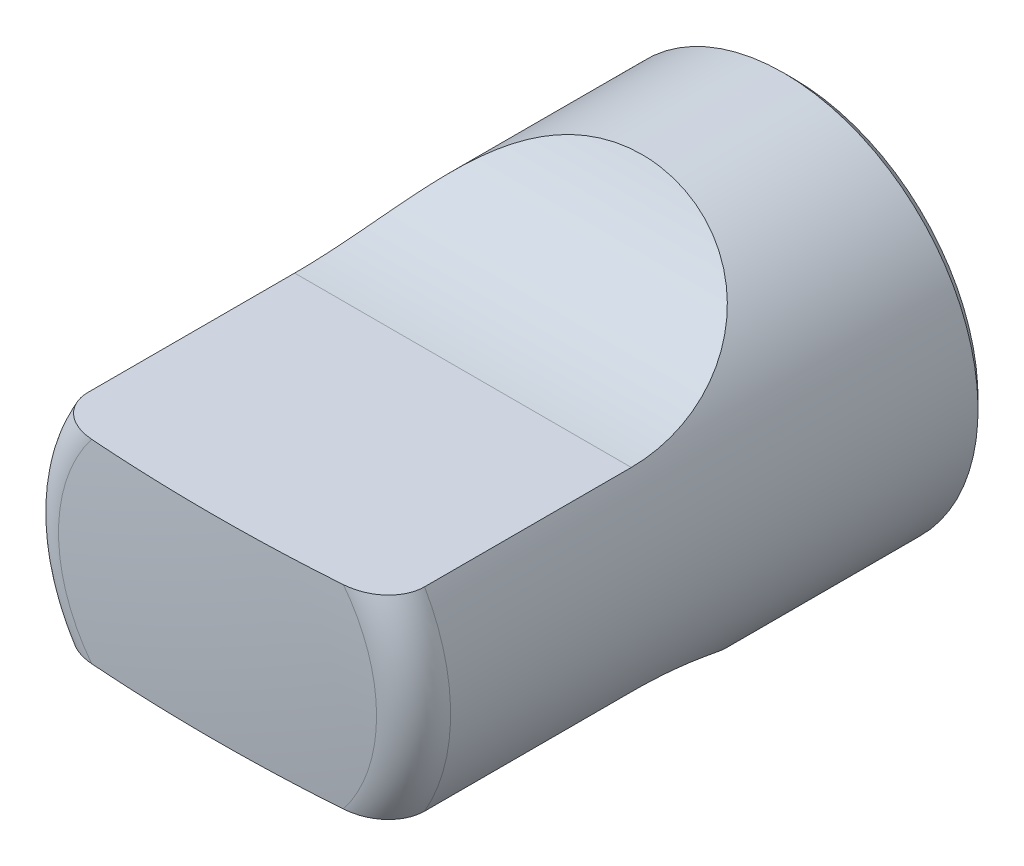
ISO-10303-21;
HEADER;
FILE_DESCRIPTION(('STEP AP214'),'2;1');
FILE_NAME('part.step','',(''),(''),'','','');
FILE_SCHEMA(('AUTOMOTIVE_DESIGN { 1 0 10303 214 1 1 1 1 }'));
ENDSEC;
DATA;
#1=APPLICATION_CONTEXT('core data for automotive mechanical design processes');
#2=APPLICATION_PROTOCOL_DEFINITION('international standard','automotive_design',2000,#1);
#3=PRODUCT_CONTEXT('',#1,'mechanical');
#4=PRODUCT('Part','Part','',(#3));
#5=PRODUCT_RELATED_PRODUCT_CATEGORY('part','',(#4));
#6=PRODUCT_DEFINITION_FORMATION('','',#4);
#7=PRODUCT_DEFINITION_CONTEXT('part definition',#1,'design');
#8=PRODUCT_DEFINITION('design','',#6,#7);
#9=PRODUCT_DEFINITION_SHAPE('','',#8);
#10=(LENGTH_UNIT() NAMED_UNIT(*) SI_UNIT(.MILLI.,.METRE.));
#11=(NAMED_UNIT(*) PLANE_ANGLE_UNIT() SI_UNIT($,.RADIAN.));
#12=(NAMED_UNIT(*) SI_UNIT($,.STERADIAN.) SOLID_ANGLE_UNIT());
#13=UNCERTAINTY_MEASURE_WITH_UNIT(LENGTH_MEASURE(1.E-05),#10,'distance_accuracy_value','');
#14=(GEOMETRIC_REPRESENTATION_CONTEXT(3) GLOBAL_UNCERTAINTY_ASSIGNED_CONTEXT((#13)) GLOBAL_UNIT_ASSIGNED_CONTEXT((#10,
#11,#12)) REPRESENTATION_CONTEXT('',''));
#15=CARTESIAN_POINT('',(0.,0.,0.));
#16=DIRECTION('',(0.,0.,1.));
#17=DIRECTION('',(1.,0.,0.));
#18=AXIS2_PLACEMENT_3D('',#15,#16,#17);
#19=CARTESIAN_POINT('',(1.24032728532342E-13,0.,-59.9999999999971));
#20=DIRECTION('',(0.,0.,-1.));
#21=DIRECTION('',(1.,0.,0.));
#22=AXIS2_PLACEMENT_3D('',#19,#20,#21);
#23=SPHERICAL_SURFACE('',#22,89.9999999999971);
#24=CARTESIAN_POINT('',(0.,0.,29.6273275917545));
#25=DIRECTION('',(0.,0.,-1.));
#26=DIRECTION('',(0.,1.,0.));
#27=AXIS2_PLACEMENT_3D('',#24,#25,#26);
#28=CIRCLE('',#27,8.18181818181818);
#29=CARTESIAN_POINT('',(-6.47627584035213,-5.,29.6273275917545));
#30=VERTEX_POINT('',#29);
#31=CARTESIAN_POINT('',(-6.47627584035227,5.,29.6273275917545));
#32=VERTEX_POINT('',#31);
#33=EDGE_CURVE('E135',#30,#32,#28,.T.);
#34=ORIENTED_EDGE('',*,*,#33,.F.);
#35=CARTESIAN_POINT('',(1.24032728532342E-13,-5.,-59.9999999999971));
#36=DIRECTION('',(0.,-1.,0.));
#37=DIRECTION('',(1.,0.,0.));
#38=AXIS2_PLACEMENT_3D('',#35,#36,#37);
#39=CIRCLE('',#38,89.8610037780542);
#40=CARTESIAN_POINT('',(6.47627584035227,-5.,29.6273275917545));
#41=VERTEX_POINT('',#40);
#42=EDGE_CURVE('E136',#30,#41,#39,.F.);
#43=ORIENTED_EDGE('',*,*,#42,.T.);
#44=CARTESIAN_POINT('',(6.47627584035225,5.,29.6273275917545));
#45=VERTEX_POINT('',#44);
#46=EDGE_CURVE('E69',#45,#41,#28,.T.);
#47=ORIENTED_EDGE('',*,*,#46,.F.);
#48=CARTESIAN_POINT('',(1.24032728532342E-13,5.,-59.9999999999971));
#49=DIRECTION('',(0.,1.,0.));
#50=DIRECTION('',(-1.,0.,0.));
#51=AXIS2_PLACEMENT_3D('',#48,#49,#50);
#52=CIRCLE('',#51,89.8610037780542);
#53=EDGE_CURVE('E139',#45,#32,#52,.F.);
#54=ORIENTED_EDGE('',*,*,#53,.T.);
#55=EDGE_LOOP('',(#34,#43,#47,#54));
#56=FACE_BOUND('',#55,.T.);
#57=ADVANCED_FACE('F14',(#56),#23,.T.);
#58=CARTESIAN_POINT('',(0.,0.,27.6356092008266));
#59=DIRECTION('',(0.,0.,-1.));
#60=DIRECTION('',(0.,1.,0.));
#61=AXIS2_PLACEMENT_3D('',#58,#59,#60);
#62=TOROIDAL_SURFACE('',#61,8.,2.);
#63=CARTESIAN_POINT('',(0.,0.,27.6356092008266));
#64=DIRECTION('',(0.,0.,-1.));
#65=DIRECTION('',(0.,1.,0.));
#66=AXIS2_PLACEMENT_3D('',#63,#64,#65);
#67=CIRCLE('',#66,10.);
#68=CARTESIAN_POINT('',(-8.66025403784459,-5.,27.6356092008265));
#69=VERTEX_POINT('',#68);
#70=CARTESIAN_POINT('',(-8.66025403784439,5.,27.6356092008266));
#71=VERTEX_POINT('',#70);
#72=EDGE_CURVE('E82',#69,#71,#67,.T.);
#73=ORIENTED_EDGE('',*,*,#72,.F.);
#74=CARTESIAN_POINT('',(-8.53884703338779,-5.,28.2749884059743));
#75=CARTESIAN_POINT('',(-8.49862986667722,-5.,28.3778319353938));
#76=CARTESIAN_POINT('',(-8.4488702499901,-5.,28.4771230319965));
#77=CARTESIAN_POINT('',(-8.3327347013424,-5.,28.6656408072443));
#78=CARTESIAN_POINT('',(-8.26631239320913,-5.,28.7548383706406));
#79=CARTESIAN_POINT('',(-8.12019619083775,-5.,28.9206224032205));
#80=CARTESIAN_POINT('',(-8.04058137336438,-5.,28.9972789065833));
#81=CARTESIAN_POINT('',(-7.87073249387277,-5.,29.1375355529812));
#82=CARTESIAN_POINT('',(-7.78050303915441,-5.,29.2011413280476));
#83=CARTESIAN_POINT('',(-7.5825462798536,-5.,29.320742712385));
#84=CARTESIAN_POINT('',(-7.47397180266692,-5.,29.3753303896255));
#85=CARTESIAN_POINT('',(-7.25019339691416,-5.,29.4685534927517));
#86=CARTESIAN_POINT('',(-7.13498512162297,-5.,29.5071783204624));
#87=CARTESIAN_POINT('',(-6.8800428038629,-5.,29.5744882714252));
#88=CARTESIAN_POINT('',(-6.73954107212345,-5.,29.6002569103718));
#89=CARTESIAN_POINT('',(-6.45638455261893,-5.,29.6319981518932));
#90=CARTESIAN_POINT('',(-6.31372896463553,-5.,29.6379632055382));
#91=CARTESIAN_POINT('',(-6.00105981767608,-5.,29.6309871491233));
#92=CARTESIAN_POINT('',(-5.83113611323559,-5.,29.6141323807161));
#93=CARTESIAN_POINT('',(-5.49512859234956,-5.,29.5566065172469));
#94=CARTESIAN_POINT('',(-5.32905175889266,-5.,29.5158951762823));
#95=CARTESIAN_POINT('',(-5.07078624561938,-5.,29.4336631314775));
#96=CARTESIAN_POINT('',(-4.97624167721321,-5.,29.3993292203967));
#97=CARTESIAN_POINT('',(-4.79022289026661,-5.,29.3231818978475));
#98=CARTESIAN_POINT('',(-4.69874779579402,-5.,29.2813706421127));
#99=CARTESIAN_POINT('',(-4.51965977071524,-5.,29.1903725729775));
#100=CARTESIAN_POINT('',(-4.43204278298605,-5.,29.1411937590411));
#101=CARTESIAN_POINT('',(-4.26152862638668,-5.,29.0353223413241));
#102=CARTESIAN_POINT('',(-4.1786282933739,-5.,28.9786348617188));
#103=CARTESIAN_POINT('',(-4.01190187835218,-5.,28.8521444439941));
#104=CARTESIAN_POINT('',(-3.92860746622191,-5.,28.7816333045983));
#105=CARTESIAN_POINT('',(-3.77167288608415,-5.,28.6305220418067));
#106=CARTESIAN_POINT('',(-3.69802175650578,-5.,28.5499335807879));
#107=CARTESIAN_POINT('',(-3.58030717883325,-5.,28.3978808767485));
#108=CARTESIAN_POINT('',(-3.53335072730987,-5.,28.3286805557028));
#109=CARTESIAN_POINT('',(-3.45077579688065,-5.,28.1837821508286));
#110=CARTESIAN_POINT('',(-3.41513559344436,-5.,28.1080968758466));
#111=CARTESIAN_POINT('',(-3.36509562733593,-5.,27.9684431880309));
#112=CARTESIAN_POINT('',(-3.34775267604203,-5.,27.9055420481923));
#113=CARTESIAN_POINT('',(-3.32391599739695,-5.,27.7777247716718));
#114=CARTESIAN_POINT('',(-3.3174102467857,-5.,27.7128109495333));
#115=CARTESIAN_POINT('',(-3.31597305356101,-5.,27.5827249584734));
#116=CARTESIAN_POINT('',(-3.3210641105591,-5.,27.5175525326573));
#117=CARTESIAN_POINT('',(-3.34226898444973,-5.,27.3890206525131));
#118=CARTESIAN_POINT('',(-3.35839379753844,-5.,27.32566307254));
#119=CARTESIAN_POINT('',(-3.40601008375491,-5.,27.1846827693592));
#120=CARTESIAN_POINT('',(-3.44056165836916,-5.,27.1081068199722));
#121=CARTESIAN_POINT('',(-3.52139508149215,-5.,26.9614087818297));
#122=CARTESIAN_POINT('',(-3.56770414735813,-5.,26.8913021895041));
#123=CARTESIAN_POINT('',(-3.65812614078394,-5.,26.7718325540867));
#124=CARTESIAN_POINT('',(-3.7006257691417,-5.,26.721221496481));
#125=CARTESIAN_POINT('',(-3.78985579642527,-5.,26.6238592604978));
#126=CARTESIAN_POINT('',(-3.83658861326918,-5.,26.5771103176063));
#127=CARTESIAN_POINT('',(-3.98200833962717,-5.,26.4422059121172));
#128=CARTESIAN_POINT('',(-4.08581280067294,-5.,26.3595229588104));
#129=CARTESIAN_POINT('',(-4.27577354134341,-5.,26.2264653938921));
#130=CARTESIAN_POINT('',(-4.3599431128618,-5.,26.173158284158));
#131=CARTESIAN_POINT('',(-4.53255574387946,-5.,26.0738570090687));
#132=CARTESIAN_POINT('',(-4.62100074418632,-5.,26.0278662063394));
#133=CARTESIAN_POINT('',(-4.80133793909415,-5.,25.9431663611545));
#134=CARTESIAN_POINT('',(-4.89323125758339,-5.,25.9044597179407));
#135=CARTESIAN_POINT('',(-5.07980729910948,-5.,25.8344526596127));
#136=CARTESIAN_POINT('',(-5.17449100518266,-5.,25.8031548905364));
#137=CARTESIAN_POINT('',(-5.4650304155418,-5.,25.7198237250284));
#138=CARTESIAN_POINT('',(-5.6644739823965,-5.,25.6797152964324));
#139=CARTESIAN_POINT('',(-6.0671395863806,-5.,25.6344715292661));
#140=CARTESIAN_POINT('',(-6.27035512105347,-5.,25.6292807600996));
#141=CARTESIAN_POINT('',(-6.62609820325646,-5.,25.6545159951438));
#142=CARTESIAN_POINT('',(-6.77920396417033,-5.,25.6767775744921));
#143=CARTESIAN_POINT('',(-7.07979700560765,-5.,25.745849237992));
#144=CARTESIAN_POINT('',(-7.22729088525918,-5.,25.7926294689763));
#145=CARTESIAN_POINT('',(-7.48743711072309,-5.,25.9019320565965));
#146=CARTESIAN_POINT('',(-7.60176443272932,-5.,25.9604564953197));
#147=CARTESIAN_POINT('',(-7.81932798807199,-5.,26.0955709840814));
#148=CARTESIAN_POINT('',(-7.92256565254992,-5.,26.172158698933));
#149=CARTESIAN_POINT('',(-8.11441792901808,-5.,26.3433636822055));
#150=CARTESIAN_POINT('',(-8.20291465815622,-5.,26.4381143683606));
#151=CARTESIAN_POINT('',(-8.35959925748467,-5.,26.6431766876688));
#152=CARTESIAN_POINT('',(-8.42780679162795,-5.,26.7534731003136));
#153=CARTESIAN_POINT('',(-8.53194121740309,-5.,26.9698400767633));
#154=CARTESIAN_POINT('',(-8.57102270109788,-5.,27.0743956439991));
#155=CARTESIAN_POINT('',(-8.628859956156,-5.,27.289027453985));
#156=CARTESIAN_POINT('',(-8.6476223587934,-5.,27.3991018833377));
#157=CARTESIAN_POINT('',(-8.66294701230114,-5.,27.6096345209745));
#158=CARTESIAN_POINT('',(-8.66154466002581,-5.,27.7099515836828));
#159=CARTESIAN_POINT('',(-8.64150448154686,-5.,27.908708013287));
#160=CARTESIAN_POINT('',(-8.62290311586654,-5.,28.0071509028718));
#161=CARTESIAN_POINT('',(-8.58810090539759,-5.,28.1322911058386));
#162=CARTESIAN_POINT('',(-8.57926143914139,-5.,28.161176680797));
#163=CARTESIAN_POINT('',(-8.5601348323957,-5.,28.2184595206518));
#164=CARTESIAN_POINT('',(-8.54984792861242,-5.,28.2468568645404));
#165=CARTESIAN_POINT('',(-8.53884703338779,-5.,28.2749884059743));
#166=B_SPLINE_CURVE_WITH_KNOTS('',3,(#74,#75,#76,#77,#78,#79,#80,#81,#82,#83,#84,#85,#86,#87,
#88,#89,#90,#91,#92,#93,#94,#95,#96,#97,#98,#99,#100,#101,#102,#103,#104,#105,#106,#107,#108,
#109,#110,#111,#112,#113,#114,#115,#116,#117,#118,#119,#120,#121,#122,#123,#124,#125,#126,#127,
#128,#129,#130,#131,#132,#133,#134,#135,#136,#137,#138,#139,#140,#141,#142,#143,#144,#145,#146,
#147,#148,#149,#150,#151,#152,#153,#154,#155,#156,#157,#158,#159,#160,#161,#162,#163,#164,#165),
.UNSPECIFIED.,.T.,.F.,(4,2,2,2,2,2,2,2,2,2,2,2,2,2,2,2,2,2,2,2,2,2,2,2,2,2,2,2,2,2,2,2,2,2,2,2,
2,2,2,2,2,2,2,2,2,4),(0.,0.331155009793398,0.663242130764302,0.993406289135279,1.32342766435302,
1.68662712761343,2.05006734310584,2.47701893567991,2.90413325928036,3.41453759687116,
3.9258054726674,4.22728346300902,4.52867467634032,4.82974098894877,5.1306028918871,
5.45729721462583,5.78361689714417,6.03373449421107,6.2833689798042,6.47829481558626,
6.6730042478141,6.86809176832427,7.06337399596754,7.31400746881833,7.565226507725,
7.76322218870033,7.96133168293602,8.35804430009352,8.65661805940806,8.95532865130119,
9.25413746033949,9.55305282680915,10.1603892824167,10.7667613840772,11.2291524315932,
11.6909817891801,12.0747413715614,12.4584513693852,12.8450961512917,13.2313649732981,
13.5643629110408,13.8972521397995,14.1967981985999,14.4957106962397,14.5863087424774,
14.6768919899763),.UNSPECIFIED.);
#167=EDGE_CURVE('E151',#69,#30,#166,.T.);
#168=ORIENTED_EDGE('',*,*,#167,.T.);
#169=ORIENTED_EDGE('',*,*,#33,.T.);
#170=CARTESIAN_POINT('',(-8.53884703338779,5.,28.2749884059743));
#171=CARTESIAN_POINT('',(-8.57465519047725,5.,28.1833870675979));
#172=CARTESIAN_POINT('',(-8.60298228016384,5.,28.0887833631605));
#173=CARTESIAN_POINT('',(-8.64337743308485,5.,27.8961017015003));
#174=CARTESIAN_POINT('',(-8.6554333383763,5.,27.7980212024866));
#175=CARTESIAN_POINT('',(-8.66270924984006,5.,27.6011975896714));
#176=CARTESIAN_POINT('',(-8.65792427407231,5.,27.5024542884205));
#177=CARTESIAN_POINT('',(-8.63172743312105,5.,27.3072256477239));
#178=CARTESIAN_POINT('',(-8.6103175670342,5.,27.2107400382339));
#179=CARTESIAN_POINT('',(-8.55198350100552,5.,27.0231252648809));
#180=CARTESIAN_POINT('',(-8.51513557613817,5.,26.9319722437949));
#181=CARTESIAN_POINT('',(-8.42745715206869,5.,26.7566871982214));
#182=CARTESIAN_POINT('',(-8.37662426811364,5.,26.6725563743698));
#183=CARTESIAN_POINT('',(-8.25959428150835,5.,26.508404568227));
#184=CARTESIAN_POINT('',(-8.19268556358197,5.,26.4288926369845));
#185=CARTESIAN_POINT('',(-8.04771755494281,5.,26.2808253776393));
#186=CARTESIAN_POINT('',(-7.9696541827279,5.,26.2122740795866));
#187=CARTESIAN_POINT('',(-7.79526996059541,5.,26.0796197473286));
#188=CARTESIAN_POINT('',(-7.69788209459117,5.,26.0169229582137));
#189=CARTESIAN_POINT('',(-7.49513098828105,5.,25.9062016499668));
#190=CARTESIAN_POINT('',(-7.38976376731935,5.,25.8581845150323));
#191=CARTESIAN_POINT('',(-7.15638460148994,5.,25.7700410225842));
#192=CARTESIAN_POINT('',(-7.02743968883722,5.,25.732391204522));
#193=CARTESIAN_POINT('',(-6.76559566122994,5.,25.6754952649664));
#194=CARTESIAN_POINT('',(-6.63269444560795,5.,25.6562591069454));
#195=CARTESIAN_POINT('',(-6.34016165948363,5.,25.6329711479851));
#196=CARTESIAN_POINT('',(-6.18024559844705,5.,25.6324955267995));
#197=CARTESIAN_POINT('',(-5.86191918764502,5.,25.6538098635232));
#198=CARTESIAN_POINT('',(-5.70351022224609,5.,25.6756186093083));
#199=CARTESIAN_POINT('',(-5.36071009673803,5.,25.7458783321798));
#200=CARTESIAN_POINT('',(-5.17718352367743,5.,25.7986477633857));
#201=CARTESIAN_POINT('',(-4.90953524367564,5.,25.8980122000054));
#202=CARTESIAN_POINT('',(-4.82153257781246,5.,25.9345354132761));
#203=CARTESIAN_POINT('',(-4.64862345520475,5.,26.0142466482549));
#204=CARTESIAN_POINT('',(-4.56371619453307,5.,26.0574329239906));
#205=CARTESIAN_POINT('',(-4.35238427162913,5.,26.1758427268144));
#206=CARTESIAN_POINT('',(-4.22848051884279,5.,26.2557202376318));
#207=CARTESIAN_POINT('',(-4.0522477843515,5.,26.3880580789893));
#208=CARTESIAN_POINT('',(-3.9951349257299,5.,26.4342299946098));
#209=CARTESIAN_POINT('',(-3.88481293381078,5.,26.5310079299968));
#210=CARTESIAN_POINT('',(-3.83160187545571,5.,26.5816117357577));
#211=CARTESIAN_POINT('',(-3.71825754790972,5.,26.6998488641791));
#212=CARTESIAN_POINT('',(-3.65938346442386,5.,26.7687089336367));
#213=CARTESIAN_POINT('',(-3.55188129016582,5.,26.9140533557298));
#214=CARTESIAN_POINT('',(-3.50323823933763,5.,26.9905263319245));
#215=CARTESIAN_POINT('',(-3.42962428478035,5.,27.1328718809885));
#216=CARTESIAN_POINT('',(-3.4017885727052,5.,27.1972427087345));
#217=CARTESIAN_POINT('',(-3.35701890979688,5.,27.3296733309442));
#218=CARTESIAN_POINT('',(-3.34006937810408,5.,27.39772770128));
#219=CARTESIAN_POINT('',(-3.31888957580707,5.,27.5363831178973));
#220=CARTESIAN_POINT('',(-3.31475721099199,5.,27.6069996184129));
#221=CARTESIAN_POINT('',(-3.32006931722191,5.,27.7477253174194));
#222=CARTESIAN_POINT('',(-3.32951729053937,5.,27.8178343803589));
#223=CARTESIAN_POINT('',(-3.35907744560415,5.,27.9479135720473));
#224=CARTESIAN_POINT('',(-3.3779616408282,5.,28.0081738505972));
#225=CARTESIAN_POINT('',(-3.42398288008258,5.,28.1254162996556));
#226=CARTESIAN_POINT('',(-3.45112366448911,5.,28.1823969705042));
#227=CARTESIAN_POINT('',(-3.53278259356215,5.,28.3302746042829));
#228=CARTESIAN_POINT('',(-3.59335194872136,5.,28.417816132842));
#229=CARTESIAN_POINT('',(-3.72715512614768,5.,28.5827181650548));
#230=CARTESIAN_POINT('',(-3.80043320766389,5.,28.6600413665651));
#231=CARTESIAN_POINT('',(-3.94081092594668,5.,28.7911783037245));
#232=CARTESIAN_POINT('',(-4.00638529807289,5.,28.8466525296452));
#233=CARTESIAN_POINT('',(-4.14206665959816,5.,28.951805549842));
#234=CARTESIAN_POINT('',(-4.21217634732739,5.,29.0014808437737));
#235=CARTESIAN_POINT('',(-4.3560257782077,5.,29.095267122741));
#236=CARTESIAN_POINT('',(-4.42976610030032,5.,29.1393772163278));
#237=CARTESIAN_POINT('',(-4.5802506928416,5.,29.2221584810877));
#238=CARTESIAN_POINT('',(-4.65699617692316,5.,29.2608274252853));
#239=CARTESIAN_POINT('',(-4.89851123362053,5.,29.3721789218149));
#240=CARTESIAN_POINT('',(-5.06760901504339,5.,29.4357170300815));
#241=CARTESIAN_POINT('',(-5.4131643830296,5.,29.5379406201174));
#242=CARTESIAN_POINT('',(-5.58962538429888,5.,29.5766144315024));
#243=CARTESIAN_POINT('',(-5.97551700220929,5.,29.6309614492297));
#244=CARTESIAN_POINT('',(-6.1856544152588,5.,29.6418888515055));
#245=CARTESIAN_POINT('',(-6.60400399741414,5.,29.622420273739));
#246=CARTESIAN_POINT('',(-6.81221944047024,5.,29.5921174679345));
#247=CARTESIAN_POINT('',(-7.14723145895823,5.,29.5041237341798));
#248=CARTESIAN_POINT('',(-7.27746516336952,5.,29.4593866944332));
#249=CARTESIAN_POINT('',(-7.5290630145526,5.,29.3493359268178));
#250=CARTESIAN_POINT('',(-7.65042786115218,5.,29.28402382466));
#251=CARTESIAN_POINT('',(-7.88077822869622,5.,29.1318308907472));
#252=CARTESIAN_POINT('',(-7.98963525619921,5.,29.0447511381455));
#253=CARTESIAN_POINT('',(-8.13815945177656,5.,28.8994667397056));
#254=CARTESIAN_POINT('',(-8.18518069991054,5.,28.8486334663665));
#255=CARTESIAN_POINT('',(-8.27368554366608,5.,28.7423745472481));
#256=CARTESIAN_POINT('',(-8.31517281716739,5.,28.6869519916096));
#257=CARTESIAN_POINT('',(-8.39062490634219,5.,28.5738920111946));
#258=CARTESIAN_POINT('',(-8.42479668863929,5.,28.5163928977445));
#259=CARTESIAN_POINT('',(-8.48674537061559,5.,28.3980538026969));
#260=CARTESIAN_POINT('',(-8.51452230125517,5.,28.3372138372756));
#261=CARTESIAN_POINT('',(-8.53884703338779,5.,28.2749884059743));
#262=B_SPLINE_CURVE_WITH_KNOTS('',3,(#170,#171,#172,#173,#174,#175,#176,#177,#178,#179,#180,
#181,#182,#183,#184,#185,#186,#187,#188,#189,#190,#191,#192,#193,#194,#195,#196,#197,#198,#199,
#200,#201,#202,#203,#204,#205,#206,#207,#208,#209,#210,#211,#212,#213,#214,#215,#216,#217,#218,
#219,#220,#221,#222,#223,#224,#225,#226,#227,#228,#229,#230,#231,#232,#233,#234,#235,#236,#237,
#238,#239,#240,#241,#242,#243,#244,#245,#246,#247,#248,#249,#250,#251,#252,#253,#254,#255,#256,
#257,#258,#259,#260,#261),.UNSPECIFIED.,.T.,.F.,(4,2,2,2,2,2,2,2,2,2,2,2,2,2,2,2,2,2,2,2,2,2,2,
2,2,2,2,2,2,2,2,2,2,2,2,2,2,2,2,2,2,2,2,2,2,4),(0.,0.294826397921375,0.589872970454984,
0.885006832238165,1.18010521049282,1.47376247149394,1.76746983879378,2.07794956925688,
2.38854319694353,2.73467194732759,3.08097452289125,3.48245851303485,3.88415962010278,
4.36212547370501,4.84049463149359,5.41089676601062,5.69650645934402,5.98204143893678,
6.42279093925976,6.64293376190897,6.86296723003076,7.13406216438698,7.40475789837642,
7.61437248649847,7.82368639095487,8.03459528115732,8.24555857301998,8.43430267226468,
8.62313240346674,8.9406718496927,9.25934021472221,9.51667642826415,9.77416718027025,
10.0316991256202,10.2893361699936,10.8292093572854,11.3693357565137,11.9970348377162,
12.6233177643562,13.0348549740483,13.446359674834,13.8617718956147,14.0692000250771,
14.2764896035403,14.4767682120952,14.6770458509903),.UNSPECIFIED.);
#263=EDGE_CURVE('E161',#32,#71,#262,.T.);
#264=ORIENTED_EDGE('',*,*,#263,.T.);
#265=EDGE_LOOP('',(#73,#168,#169,#264));
#266=FACE_BOUND('',#265,.T.);
#267=ADVANCED_FACE('F125',(#266),#62,.T.);
#268=CARTESIAN_POINT('',(8.66025403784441,5.,27.6356092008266));
#269=VERTEX_POINT('',#268);
#270=CARTESIAN_POINT('',(8.66025403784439,-5.,27.6356092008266));
#271=VERTEX_POINT('',#270);
#272=EDGE_CURVE('E141',#269,#271,#67,.T.);
#273=ORIENTED_EDGE('',*,*,#272,.F.);
#274=CARTESIAN_POINT('',(3.82582183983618,5.,28.6823433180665));
#275=CARTESIAN_POINT('',(3.76216427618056,5.,28.6193655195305));
#276=CARTESIAN_POINT('',(3.70188308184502,5.,28.5529273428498));
#277=CARTESIAN_POINT('',(3.59052722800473,5.,28.4126008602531));
#278=CARTESIAN_POINT('',(3.53944992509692,5.,28.3387147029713));
#279=CARTESIAN_POINT('',(3.4584662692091,5.,28.1977830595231));
#280=CARTESIAN_POINT('',(3.42639121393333,5.,28.1320025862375));
#281=CARTESIAN_POINT('',(3.37340373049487,5.,27.9960940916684));
#282=CARTESIAN_POINT('',(3.35247254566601,5.,27.9259735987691));
#283=CARTESIAN_POINT('',(3.32399349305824,5.,27.7822444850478));
#284=CARTESIAN_POINT('',(3.31658107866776,5.,27.7086080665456));
#285=CARTESIAN_POINT('',(3.31666886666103,5.,27.5613403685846));
#286=CARTESIAN_POINT('',(3.32416815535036,5.,27.4877090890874));
#287=CARTESIAN_POINT('',(3.3508628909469,5.,27.3537045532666));
#288=CARTESIAN_POINT('',(3.36822150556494,5.,27.2929472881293));
#289=CARTESIAN_POINT('',(3.41147916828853,5.,27.1745866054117));
#290=CARTESIAN_POINT('',(3.43738244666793,5.,27.1169847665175));
#291=CARTESIAN_POINT('',(3.51459857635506,5.,26.9702249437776));
#292=CARTESIAN_POINT('',(3.57163087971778,5.,26.8840916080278));
#293=CARTESIAN_POINT('',(3.69822621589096,5.,26.7215019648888));
#294=CARTESIAN_POINT('',(3.76783138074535,5.,26.6450797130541));
#295=CARTESIAN_POINT('',(3.9016963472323,5.,26.5150100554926));
#296=CARTESIAN_POINT('',(3.96445860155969,5.,26.4597943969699));
#297=CARTESIAN_POINT('',(4.09450671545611,5.,26.354922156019));
#298=CARTESIAN_POINT('',(4.16179531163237,5.,26.3052689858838));
#299=CARTESIAN_POINT('',(4.29999833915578,5.,26.2112773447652));
#300=CARTESIAN_POINT('',(4.37091372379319,5.,26.1669402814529));
#301=CARTESIAN_POINT('',(4.51574023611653,5.,26.0834411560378));
#302=CARTESIAN_POINT('',(4.5896525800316,5.,26.0442812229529));
#303=CARTESIAN_POINT('',(4.82299867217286,5.,25.9306642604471));
#304=CARTESIAN_POINT('',(4.98679235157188,5.,25.8649483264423));
#305=CARTESIAN_POINT('',(5.32192013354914,5.,25.756990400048));
#306=CARTESIAN_POINT('',(5.49325728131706,5.,25.7147579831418));
#307=CARTESIAN_POINT('',(5.87373346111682,5.,25.6500047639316));
#308=CARTESIAN_POINT('',(6.08382316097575,5.,25.6328140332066));
#309=CARTESIAN_POINT('',(6.50346303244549,5.,25.6391275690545));
#310=CARTESIAN_POINT('',(6.71301350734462,5.,25.6625612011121));
#311=CARTESIAN_POINT('',(7.05433722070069,5.,25.739381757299));
#312=CARTESIAN_POINT('',(7.18894613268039,5.,25.7803240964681));
#313=CARTESIAN_POINT('',(7.44972452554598,5.,25.8835173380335));
#314=CARTESIAN_POINT('',(7.57590582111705,5.,25.9457376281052));
#315=CARTESIAN_POINT('',(7.79715818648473,5.,26.0808110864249));
#316=CARTESIAN_POINT('',(7.894055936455,5.,26.1506660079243));
#317=CARTESIAN_POINT('',(8.0750225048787,5.,26.3055091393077));
#318=CARTESIAN_POINT('',(8.15909288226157,5.,26.3904955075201));
#319=CARTESIAN_POINT('',(8.31124040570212,5.,26.574762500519));
#320=CARTESIAN_POINT('',(8.37921320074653,5.,26.6741300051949));
#321=CARTESIAN_POINT('',(8.49485018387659,5.,26.8840811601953));
#322=CARTESIAN_POINT('',(8.54252829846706,5.,26.9946570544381));
#323=CARTESIAN_POINT('',(8.61046467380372,5.,27.2096206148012));
#324=CARTESIAN_POINT('',(8.63329444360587,5.,27.3131990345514));
#325=CARTESIAN_POINT('',(8.65978245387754,5.,27.5227642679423));
#326=CARTESIAN_POINT('',(8.66345052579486,5.,27.628749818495));
#327=CARTESIAN_POINT('',(8.6518670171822,5.,27.8321855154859));
#328=CARTESIAN_POINT('',(8.63792353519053,5.,27.9297132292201));
#329=CARTESIAN_POINT('',(8.5939647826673,5.,28.1210556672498));
#330=CARTESIAN_POINT('',(8.56395057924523,5.,28.2148706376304));
#331=CARTESIAN_POINT('',(8.48886103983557,5.,28.3970546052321));
#332=CARTESIAN_POINT('',(8.44367453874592,5.,28.4853775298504));
#333=CARTESIAN_POINT('',(8.34009185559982,5.,28.6538746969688));
#334=CARTESIAN_POINT('',(8.28169257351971,5.,28.7340470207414));
#335=CARTESIAN_POINT('',(8.14896018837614,5.,28.8904664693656));
#336=CARTESIAN_POINT('',(8.07376632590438,5.,28.9659809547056));
#337=CARTESIAN_POINT('',(7.91304839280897,5.,29.105022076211));
#338=CARTESIAN_POINT('',(7.8275202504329,5.,29.1685439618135));
#339=CARTESIAN_POINT('',(7.63709187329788,5.,29.2905288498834));
#340=CARTESIAN_POINT('',(7.53111323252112,5.,29.3473041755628));
#341=CARTESIAN_POINT('',(7.31217361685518,5.,29.4451656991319));
#342=CARTESIAN_POINT('',(7.19920863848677,5.,29.4862428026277));
#343=CARTESIAN_POINT('',(6.94935950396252,5.,29.5589196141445));
#344=CARTESIAN_POINT('',(6.81166693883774,5.,29.5877321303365));
#345=CARTESIAN_POINT('',(6.53368102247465,5.,29.6259024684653));
#346=CARTESIAN_POINT('',(6.39338679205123,5.,29.6352535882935));
#347=CARTESIAN_POINT('',(6.08553123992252,5.,29.6360120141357));
#348=CARTESIAN_POINT('',(5.91796327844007,5.,29.6235838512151));
#349=CARTESIAN_POINT('',(5.58598712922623,5.,29.5752986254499));
#350=CARTESIAN_POINT('',(5.4215852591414,5.,29.5393988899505));
#351=CARTESIAN_POINT('',(5.16495146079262,5.,29.4650288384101));
#352=CARTESIAN_POINT('',(5.07062054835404,5.,29.4335727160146));
#353=CARTESIAN_POINT('',(4.88475000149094,5.,29.3632970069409));
#354=CARTESIAN_POINT('',(4.7932096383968,5.,29.3244793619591));
#355=CARTESIAN_POINT('',(4.61373949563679,5.,29.2396750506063));
#356=CARTESIAN_POINT('',(4.52580275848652,5.,29.1937031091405));
#357=CARTESIAN_POINT('',(4.35417644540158,5.,29.0944990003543));
#358=CARTESIAN_POINT('',(4.27048392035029,5.,29.0412719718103));
#359=CARTESIAN_POINT('',(4.12493534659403,5.,28.9389077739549));
#360=CARTESIAN_POINT('',(4.06210813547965,5.,28.8911521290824));
#361=CARTESIAN_POINT('',(3.94058791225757,5.,28.79060715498));
#362=CARTESIAN_POINT('',(3.88189500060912,5.,28.737817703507));
#363=CARTESIAN_POINT('',(3.82582183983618,5.,28.6823433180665));
#364=B_SPLINE_CURVE_WITH_KNOTS('',3,(#274,#275,#276,#277,#278,#279,#280,#281,#282,#283,#284,
#285,#286,#287,#288,#289,#290,#291,#292,#293,#294,#295,#296,#297,#298,#299,#300,#301,#302,#303,
#304,#305,#306,#307,#308,#309,#310,#311,#312,#313,#314,#315,#316,#317,#318,#319,#320,#321,#322,
#323,#324,#325,#326,#327,#328,#329,#330,#331,#332,#333,#334,#335,#336,#337,#338,#339,#340,#341,
#342,#343,#344,#345,#346,#347,#348,#349,#350,#351,#352,#353,#354,#355,#356,#357,#358,#359,#360,
#361,#362,#363),.UNSPECIFIED.,.T.,.F.,(4,2,2,2,2,2,2,2,2,2,2,2,2,2,2,2,2,2,2,2,2,2,2,2,2,2,2,2,
2,2,2,2,2,2,2,2,2,2,2,2,2,2,2,2,4),(0.,0.268516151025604,0.536955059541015,0.75570942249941,
0.97409441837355,1.19465578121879,1.41520362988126,1.60403906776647,1.79296813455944,
2.10111956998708,2.41032346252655,2.66077246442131,2.91137427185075,3.16204229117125,
3.41281307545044,3.94033840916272,4.46807868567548,5.09697737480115,5.72478367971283,
6.14530228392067,6.56521842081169,6.92209901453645,7.27893620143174,7.63802683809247,
7.99687066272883,8.31337454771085,8.6297160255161,8.92388444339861,9.2180333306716,
9.51438621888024,9.81080871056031,10.1292255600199,10.4477682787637,10.8070754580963,
11.1665904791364,11.5870527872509,12.0076598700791,12.5099121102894,13.0130800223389,
13.3111231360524,13.6090877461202,13.906447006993,14.2035967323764,14.4401151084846,
14.6766392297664),.UNSPECIFIED.);
#365=EDGE_CURVE('E169',#269,#45,#364,.T.);
#366=ORIENTED_EDGE('',*,*,#365,.T.);
#367=ORIENTED_EDGE('',*,*,#46,.T.);
#368=CARTESIAN_POINT('',(3.82582183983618,-5.,28.6823433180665));
#369=CARTESIAN_POINT('',(3.88607941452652,-5.,28.7419632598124));
#370=CARTESIAN_POINT('',(3.94938602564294,-5.,28.7984960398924));
#371=CARTESIAN_POINT('',(4.08073998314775,-5.,28.9058158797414));
#372=CARTESIAN_POINT('',(4.14879158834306,-5.,28.9565976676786));
#373=CARTESIAN_POINT('',(4.2888897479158,-5.,29.0528143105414));
#374=CARTESIAN_POINT('',(4.36094852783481,-5.,29.0982313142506));
#375=CARTESIAN_POINT('',(4.50819569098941,-5.,29.1836949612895));
#376=CARTESIAN_POINT('',(4.58338542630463,-5.,29.2237392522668));
#377=CARTESIAN_POINT('',(4.81693785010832,-5.,29.3378904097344));
#378=CARTESIAN_POINT('',(4.97955517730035,-5.,29.4034935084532));
#379=CARTESIAN_POINT('',(5.31213780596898,-5.,29.5114991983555));
#380=CARTESIAN_POINT('',(5.4820995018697,-5.,29.5539130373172));
#381=CARTESIAN_POINT('',(5.86109694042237,-5.,29.6197914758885));
#382=CARTESIAN_POINT('',(6.07113479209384,-5.,29.6377520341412));
#383=CARTESIAN_POINT('',(6.49087604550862,-5.,29.6330704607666));
#384=CARTESIAN_POINT('',(6.70057947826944,-5.,29.61048892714));
#385=CARTESIAN_POINT('',(7.04266193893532,-5.,29.5350676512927));
#386=CARTESIAN_POINT('',(7.17780486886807,-5.,29.4946102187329));
#387=CARTESIAN_POINT('',(7.43971922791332,-5.,29.3922968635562));
#388=CARTESIAN_POINT('',(7.56650264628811,-5.,29.3304724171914));
#389=CARTESIAN_POINT('',(7.78886023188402,-5.,29.1960609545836));
#390=CARTESIAN_POINT('',(7.88625873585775,-5.,29.1264981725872));
#391=CARTESIAN_POINT('',(8.06827182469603,-5.,28.9721544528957));
#392=CARTESIAN_POINT('',(8.15288790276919,-5.,28.8873752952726));
#393=CARTESIAN_POINT('',(8.30615838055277,-5.,28.7034166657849));
#394=CARTESIAN_POINT('',(8.37470798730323,-5.,28.6041491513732));
#395=CARTESIAN_POINT('',(8.49149166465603,-5.,28.3942783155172));
#396=CARTESIAN_POINT('',(8.53973978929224,-5.,28.283682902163));
#397=CARTESIAN_POINT('',(8.60868357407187,-5.,28.068639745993));
#398=CARTESIAN_POINT('',(8.63196841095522,-5.,27.965018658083));
#399=CARTESIAN_POINT('',(8.65933148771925,-5.,27.7552854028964));
#400=CARTESIAN_POINT('',(8.66341970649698,-5.,27.6491745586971));
#401=CARTESIAN_POINT('',(8.6525964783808,-5.,27.4455243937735));
#402=CARTESIAN_POINT('',(8.63901324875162,-5.,27.3479113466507));
#403=CARTESIAN_POINT('',(8.59574236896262,-5.,27.1563434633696));
#404=CARTESIAN_POINT('',(8.56605585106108,-5.,27.0623883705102));
#405=CARTESIAN_POINT('',(8.49161016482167,-5.,26.8799531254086));
#406=CARTESIAN_POINT('',(8.44675146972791,-5.,26.7915138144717));
#407=CARTESIAN_POINT('',(8.34379399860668,-5.,26.6227401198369));
#408=CARTESIAN_POINT('',(8.28569215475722,-5.,26.542407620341));
#409=CARTESIAN_POINT('',(8.15358098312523,-5.,26.3856712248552));
#410=CARTESIAN_POINT('',(8.07871601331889,-5.,26.3099907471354));
#411=CARTESIAN_POINT('',(7.91862260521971,-5.,26.1705768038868));
#412=CARTESIAN_POINT('',(7.83339006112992,-5.,26.1068480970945));
#413=CARTESIAN_POINT('',(7.64359794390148,-5.,25.9844204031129));
#414=CARTESIAN_POINT('',(7.53795964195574,-5.,25.9273978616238));
#415=CARTESIAN_POINT('',(7.31966220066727,-5.,25.8290026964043));
#416=CARTESIAN_POINT('',(7.20699917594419,-5.,25.7876388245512));
#417=CARTESIAN_POINT('',(6.95780728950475,-5.,25.7143212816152));
#418=CARTESIAN_POINT('',(6.82046436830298,-5.,25.6851417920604));
#419=CARTESIAN_POINT('',(6.54311505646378,-5.,25.6461915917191));
#420=CARTESIAN_POINT('',(6.40310752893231,-5.,25.6364293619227));
#421=CARTESIAN_POINT('',(6.09579402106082,-5.,25.634738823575));
#422=CARTESIAN_POINT('',(5.92846584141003,-5.,25.6466412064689));
#423=CARTESIAN_POINT('',(5.59705212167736,-5.,25.6938084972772));
#424=CARTESIAN_POINT('',(5.43297147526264,-5.,25.7291062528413));
#425=CARTESIAN_POINT('',(5.08131073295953,-5.,25.829777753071));
#426=CARTESIAN_POINT('',(4.89493927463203,-5.,25.8994799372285));
#427=CARTESIAN_POINT('',(4.62572180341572,-5.,26.0255159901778));
#428=CARTESIAN_POINT('',(4.53769831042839,-5.,26.0711136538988));
#429=CARTESIAN_POINT('',(4.36582895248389,-5.,26.1695706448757));
#430=CARTESIAN_POINT('',(4.28198090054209,-5.,26.2224261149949));
#431=CARTESIAN_POINT('',(4.10338214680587,-5.,26.3468717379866));
#432=CARTESIAN_POINT('',(4.00976018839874,-5.,26.4200991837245));
#433=CARTESIAN_POINT('',(3.83286424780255,-5.,26.5781847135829));
#434=CARTESIAN_POINT('',(3.749576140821,-5.,26.6630265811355));
#435=CARTESIAN_POINT('',(3.61914125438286,-5.,26.820372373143));
#436=CARTESIAN_POINT('',(3.5683591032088,-5.,26.8898359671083));
#437=CARTESIAN_POINT('',(3.47791475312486,-5.,27.0357055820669));
#438=CARTESIAN_POINT('',(3.43823228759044,-5.,27.1120986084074));
#439=CARTESIAN_POINT('',(3.38130773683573,-5.,27.2528628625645));
#440=CARTESIAN_POINT('',(3.36100809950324,-5.,27.3159826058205));
#441=CARTESIAN_POINT('',(3.33123938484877,-5.,27.4447144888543));
#442=CARTESIAN_POINT('',(3.32175590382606,-5.,27.5103231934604));
#443=CARTESIAN_POINT('',(3.31466756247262,-5.,27.6424269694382));
#444=CARTESIAN_POINT('',(3.31710387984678,-5.,27.7089243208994));
#445=CARTESIAN_POINT('',(3.33364991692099,-5.,27.8404732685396));
#446=CARTESIAN_POINT('',(3.34777261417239,-5.,27.9055231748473));
#447=CARTESIAN_POINT('',(3.39040004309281,-5.,28.0463703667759));
#448=CARTESIAN_POINT('',(3.4213738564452,-5.,28.12140848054));
#449=CARTESIAN_POINT('',(3.49492309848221,-5.,28.265509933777));
#450=CARTESIAN_POINT('',(3.53751559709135,-5.,28.3345642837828));
#451=CARTESIAN_POINT('',(3.62026863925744,-5.,28.4510408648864));
#452=CARTESIAN_POINT('',(3.65866779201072,-5.,28.4997449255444));
#453=CARTESIAN_POINT('',(3.73944599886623,-5.,28.5936268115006));
#454=CARTESIAN_POINT('',(3.78182103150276,-5.,28.6388081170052));
#455=CARTESIAN_POINT('',(3.82582183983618,-5.,28.6823433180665));
#456=B_SPLINE_CURVE_WITH_KNOTS('',3,(#368,#369,#370,#371,#372,#373,#374,#375,#376,#377,#378,
#379,#380,#381,#382,#383,#384,#385,#386,#387,#388,#389,#390,#391,#392,#393,#394,#395,#396,#397,
#398,#399,#400,#401,#402,#403,#404,#405,#406,#407,#408,#409,#410,#411,#412,#413,#414,#415,#416,
#417,#418,#419,#420,#421,#422,#423,#424,#425,#426,#427,#428,#429,#430,#431,#432,#433,#434,#435,
#436,#437,#438,#439,#440,#441,#442,#443,#444,#445,#446,#447,#448,#449,#450,#451,#452,#453,#454,
#455),.UNSPECIFIED.,.T.,.F.,(4,2,2,2,2,2,2,2,2,2,2,2,2,2,2,2,2,2,2,2,2,2,2,2,2,2,2,2,2,2,2,2,2,
2,2,2,2,2,2,2,2,2,2,4),(0.,0.254222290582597,0.508675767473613,0.763953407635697,
1.01934245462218,1.54350465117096,2.06741238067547,2.69635882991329,3.32436597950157,
3.7459939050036,4.16700334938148,4.52459171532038,4.88213827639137,5.24195576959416,
5.60152376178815,5.91844452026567,6.23520051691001,6.52946942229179,6.82371763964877,
7.11993476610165,7.41622058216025,7.73429638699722,8.05249856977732,8.41125906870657,
8.7702197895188,9.18988267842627,9.60972882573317,10.111093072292,10.6131627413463,
11.2073050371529,11.5044308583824,11.8013993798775,12.1571715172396,12.5124518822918,
12.7698533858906,13.026781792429,13.2248920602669,13.4227381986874,13.6212682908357,
13.8200191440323,14.0622177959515,14.304774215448,14.4905963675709,14.6762325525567),.UNSPECIFIED.);
#457=EDGE_CURVE('E173',#41,#271,#456,.T.);
#458=ORIENTED_EDGE('',*,*,#457,.T.);
#459=EDGE_LOOP('',(#273,#366,#367,#458));
#460=FACE_BOUND('',#459,.T.);
#461=ADVANCED_FACE('F120',(#460),#62,.T.);
#462=CARTESIAN_POINT('',(0.,0.,0.));
#463=DIRECTION('',(0.,0.,-1.));
#464=DIRECTION('',(0.,1.,0.));
#465=AXIS2_PLACEMENT_3D('',#462,#463,#464);
#466=CYLINDRICAL_SURFACE('',#465,10.);
#467=CARTESIAN_POINT('',(0.,0.,0.5));
#468=DIRECTION('',(0.,0.,-1.));
#469=DIRECTION('',(0.,1.,0.));
#470=AXIS2_PLACEMENT_3D('',#467,#468,#469);
#471=CIRCLE('',#470,10.);
#472=CARTESIAN_POINT('',(0.,10.,0.5));
#473=VERTEX_POINT('',#472);
#474=EDGE_CURVE('E145',#473,#473,#471,.T.);
#475=ORIENTED_EDGE('',*,*,#474,.F.);
#476=EDGE_LOOP('',(#475));
#477=FACE_BOUND('',#476,.T.);
#478=DIRECTION('',(0.,0.,-1.));
#479=VECTOR('',#478,1.);
#480=CARTESIAN_POINT('',(-8.66025403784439,-5.,0.));
#481=LINE('',#480,#479);
#482=CARTESIAN_POINT('',(-8.66025403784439,-5.,17.));
#483=VERTEX_POINT('',#482);
#484=EDGE_CURVE('E9',#69,#483,#481,.T.);
#485=ORIENTED_EDGE('',*,*,#484,.F.);
#486=ORIENTED_EDGE('',*,*,#72,.T.);
#487=DIRECTION('',(0.,0.,-1.));
#488=VECTOR('',#487,1.);
#489=CARTESIAN_POINT('',(-8.66025403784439,5.,0.));
#490=LINE('',#489,#488);
#491=CARTESIAN_POINT('',(-8.66025403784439,5.,17.));
#492=VERTEX_POINT('',#491);
#493=EDGE_CURVE('E68',#492,#71,#490,.F.);
#494=ORIENTED_EDGE('',*,*,#493,.F.);
#495=CARTESIAN_POINT('',(8.66025403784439,5.,17.));
#496=CARTESIAN_POINT('',(8.6602507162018,4.99999939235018,16.8717765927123));
#497=CARTESIAN_POINT('',(8.6589598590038,5.00224242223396,16.7435674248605));
#498=CARTESIAN_POINT('',(8.65377775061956,5.0112043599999,16.4873567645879));
#499=CARTESIAN_POINT('',(8.64988646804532,5.01792332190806,16.3593552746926));
#500=CARTESIAN_POINT('',(8.63427401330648,5.04477697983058,15.975935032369));
#501=CARTESIAN_POINT('',(8.61861423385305,5.07160844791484,15.7211012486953));
#502=CARTESIAN_POINT('',(8.57624103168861,5.14293766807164,15.2139354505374));
#503=CARTESIAN_POINT('',(8.54948827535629,5.18749826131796,14.9616156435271));
#504=CARTESIAN_POINT('',(8.4841303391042,5.29371526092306,14.4621600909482));
#505=CARTESIAN_POINT('',(8.44552590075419,5.35537059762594,14.2150240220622));
#506=CARTESIAN_POINT('',(8.35529898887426,5.49508022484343,13.7272065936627));
#507=CARTESIAN_POINT('',(8.3036463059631,5.57317249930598,13.4865416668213));
#508=CARTESIAN_POINT('',(8.18609637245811,5.74444148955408,13.0141977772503));
#509=CARTESIAN_POINT('',(8.12019880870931,5.83761853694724,12.7825190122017));
#510=CARTESIAN_POINT('',(7.97292703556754,6.03719938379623,12.3305778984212));
#511=CARTESIAN_POINT('',(7.89158230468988,6.14357785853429,12.1102948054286));
#512=CARTESIAN_POINT('',(7.71200639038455,6.36753799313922,11.6826784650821));
#513=CARTESIAN_POINT('',(7.61377674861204,6.48511862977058,11.4753440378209));
#514=CARTESIAN_POINT('',(7.40554499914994,6.72170026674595,11.0871506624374));
#515=CARTESIAN_POINT('',(7.29656043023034,6.84022055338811,10.9054531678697));
#516=CARTESIAN_POINT('',(7.06196756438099,7.08215976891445,10.5566177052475));
#517=CARTESIAN_POINT('',(6.93635990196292,7.20557851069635,10.3894791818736));
#518=CARTESIAN_POINT('',(6.66833504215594,7.4543081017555,10.0709319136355));
#519=CARTESIAN_POINT('',(6.52592340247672,7.57961831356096,9.91951799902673));
#520=CARTESIAN_POINT('',(6.22451466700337,7.82902630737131,9.63309723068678));
#521=CARTESIAN_POINT('',(6.06551893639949,7.95312418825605,9.49808902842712));
#522=CARTESIAN_POINT('',(5.74885660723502,8.1844399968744,9.25778258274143));
#523=CARTESIAN_POINT('',(5.5927302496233,8.29208266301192,9.15085711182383));
#524=CARTESIAN_POINT('',(5.26858707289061,8.50171934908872,8.95035228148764));
#525=CARTESIAN_POINT('',(5.100571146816,8.6037137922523,8.85677192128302));
#526=CARTESIAN_POINT('',(4.75369009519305,8.80012300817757,8.68260780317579));
#527=CARTESIAN_POINT('',(4.57482326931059,8.89453658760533,8.60202608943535));
#528=CARTESIAN_POINT('',(4.20749329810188,9.07407258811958,8.45335613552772));
#529=CARTESIAN_POINT('',(4.01902988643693,9.15919475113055,8.38526824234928));
#530=CARTESIAN_POINT('',(3.63510257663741,9.3182038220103,8.26136750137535));
#531=CARTESIAN_POINT('',(3.43969239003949,9.3921604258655,8.20547744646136));
#532=CARTESIAN_POINT('',(3.04207304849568,9.52837647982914,8.10476152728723));
#533=CARTESIAN_POINT('',(2.83986398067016,9.59063607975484,8.05993552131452));
#534=CARTESIAN_POINT('',(2.42996522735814,9.70259848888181,7.98071838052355));
#535=CARTESIAN_POINT('',(2.2222745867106,9.75229909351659,7.9463290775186));
#536=CARTESIAN_POINT('',(1.80278703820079,9.83848646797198,7.88745510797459));
#537=CARTESIAN_POINT('',(1.59098996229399,9.87497269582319,7.86297084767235));
#538=CARTESIAN_POINT('',(1.15253702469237,9.93596387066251,7.8223700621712));
#539=CARTESIAN_POINT('',(0.92571892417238,9.95967332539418,7.80680590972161));
#540=CARTESIAN_POINT('',(0.470520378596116,9.9915300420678,7.78595367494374));
#541=CARTESIAN_POINT('',(0.242139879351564,9.99967676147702,7.78066595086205));
#542=CARTESIAN_POINT('',(-0.214716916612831,10.0003044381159,7.78025736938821));
#543=CARTESIAN_POINT('',(-0.443193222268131,9.9927810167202,7.78513935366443));
#544=CARTESIAN_POINT('',(-0.898648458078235,9.96215473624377,7.8051776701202));
#545=CARTESIAN_POINT('',(-1.12562737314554,9.93905172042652,7.82033410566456));
#546=CARTESIAN_POINT('',(-1.58324945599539,9.87664992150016,7.86183646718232));
#547=CARTESIAN_POINT('',(-1.8138012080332,9.83689046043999,7.8885013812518));
#548=CARTESIAN_POINT('',(-2.26997752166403,9.74173950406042,7.95359217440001));
#549=CARTESIAN_POINT('',(-2.49560195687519,9.68634760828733,7.99201835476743));
#550=CARTESIAN_POINT('',(-2.94013138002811,9.56080291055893,8.08133025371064));
#551=CARTESIAN_POINT('',(-3.15903788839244,9.49065347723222,8.13221312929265));
#552=CARTESIAN_POINT('',(-3.58842675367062,9.33676591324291,8.24725566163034));
#553=CARTESIAN_POINT('',(-3.7989094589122,9.25302834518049,8.31141476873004));
#554=CARTESIAN_POINT('',(-4.20426614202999,9.07588912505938,8.45195237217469));
#555=CARTESIAN_POINT('',(-4.39940620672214,8.98280322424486,8.52796105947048));
#556=CARTESIAN_POINT('',(-4.77854555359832,8.78698015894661,8.6940493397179));
#557=CARTESIAN_POINT('',(-4.96254506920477,8.68424319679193,8.78412863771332));
#558=CARTESIAN_POINT('',(-5.31793030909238,8.47127562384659,8.97883411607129));
#559=CARTESIAN_POINT('',(-5.48932284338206,8.36104912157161,9.08345235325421));
#560=CARTESIAN_POINT('',(-5.81845669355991,8.13543904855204,9.30753996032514));
#561=CARTESIAN_POINT('',(-5.97619867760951,8.02005573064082,9.42700860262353));
#562=CARTESIAN_POINT('',(-6.26867466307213,7.79333072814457,9.67354047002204));
#563=CARTESIAN_POINT('',(-6.40420594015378,7.68213055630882,9.79978963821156));
#564=CARTESIAN_POINT('',(-6.66200523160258,7.45967005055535,10.0651081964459));
#565=CARTESIAN_POINT('',(-6.78427379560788,7.34840971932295,10.2041770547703));
#566=CARTESIAN_POINT('',(-7.01547969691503,7.1280126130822,10.4945363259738));
#567=CARTESIAN_POINT('',(-7.12441669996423,7.01887589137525,10.645827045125));
#568=CARTESIAN_POINT('',(-7.32918263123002,6.80478015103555,10.9597984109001));
#569=CARTESIAN_POINT('',(-7.42501123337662,6.6998212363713,11.1224793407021));
#570=CARTESIAN_POINT('',(-7.60451573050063,6.49537940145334,11.4591353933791));
#571=CARTESIAN_POINT('',(-7.68812297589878,6.39592922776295,11.6331669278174));
#572=CARTESIAN_POINT('',(-7.84323054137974,6.20474765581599,11.9905975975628));
#573=CARTESIAN_POINT('',(-7.91473079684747,6.11301629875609,12.1739967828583));
#574=CARTESIAN_POINT('',(-8.04645306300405,5.93856491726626,12.5491186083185));
#575=CARTESIAN_POINT('',(-8.10666673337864,5.85585157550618,12.7408472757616));
#576=CARTESIAN_POINT('',(-8.21657180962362,5.70061343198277,13.1313069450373));
#577=CARTESIAN_POINT('',(-8.26626294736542,5.62808888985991,13.3300381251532));
#578=CARTESIAN_POINT('',(-8.36027864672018,5.48758374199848,13.7529325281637));
#579=CARTESIAN_POINT('',(-8.4036127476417,5.4207292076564,13.9776907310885));
#580=CARTESIAN_POINT('',(-8.47953021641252,5.30118683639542,14.4327526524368));
#581=CARTESIAN_POINT('',(-8.51211165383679,5.2485015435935,14.6630573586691));
#582=CARTESIAN_POINT('',(-8.5672691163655,5.15797492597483,15.1274602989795));
#583=CARTESIAN_POINT('',(-8.58985637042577,5.12011694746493,15.3615539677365));
#584=CARTESIAN_POINT('',(-8.62565349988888,5.05957950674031,15.8323182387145));
#585=CARTESIAN_POINT('',(-8.63886759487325,5.0368932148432,16.06898763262));
#586=CARTESIAN_POINT('',(-8.65181281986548,5.01459804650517,16.421767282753));
#587=CARTESIAN_POINT('',(-8.65498315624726,5.00912082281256,16.5374173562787));
#588=CARTESIAN_POINT('',(-8.65920118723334,5.00182421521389,16.7687080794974));
#589=CARTESIAN_POINT('',(-8.6602518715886,4.99999967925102,16.8843485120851));
#590=CARTESIAN_POINT('',(-8.66025403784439,5.,17.));
#591=B_SPLINE_CURVE_WITH_KNOTS('',3,(#495,#496,#497,#498,#499,#500,#501,#502,#503,#504,#505,
#506,#507,#508,#509,#510,#511,#512,#513,#514,#515,#516,#517,#518,#519,#520,#521,#522,#523,#524,
#525,#526,#527,#528,#529,#530,#531,#532,#533,#534,#535,#536,#537,#538,#539,#540,#541,#542,#543,
#544,#545,#546,#547,#548,#549,#550,#551,#552,#553,#554,#555,#556,#557,#558,#559,#560,#561,#562,
#563,#564,#565,#566,#567,#568,#569,#570,#571,#572,#573,#574,#575,#576,#577,#578,#579,#580,#581,
#582,#583,#584,#585,#586,#587,#588,#589,#590),.UNSPECIFIED.,.F.,.F.,(4,2,2,2,2,2,2,2,2,2,2,2,2,
2,2,2,2,2,2,2,2,2,2,2,2,2,2,2,2,2,2,2,2,2,2,2,2,2,2,2,2,2,2,2,2,2,2,4),(0.,0.384615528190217,
0.769235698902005,1.53847825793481,2.31047205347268,3.08241755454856,3.85616691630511,
4.6299332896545,5.40223762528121,6.17447148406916,6.90177285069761,7.62904646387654,
8.35608021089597,9.08305415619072,9.73537324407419,10.3876433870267,11.0400160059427,
11.6924067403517,12.3405399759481,12.9886649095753,13.636903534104,14.2851687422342,
14.9701445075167,15.6551441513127,16.3403352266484,17.0255331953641,17.7310835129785,
18.4366519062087,19.142059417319,19.8474377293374,20.5340810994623,21.2207100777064,
21.9069653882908,22.5931870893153,23.2405206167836,23.8878273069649,24.5351502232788,
25.1824892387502,25.8333352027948,26.4841846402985,27.1355131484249,27.7868582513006,
28.501486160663,29.2162422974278,29.9301933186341,30.6438227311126,30.9912262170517,
31.3381393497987),.UNSPECIFIED.);
#592=CARTESIAN_POINT('',(8.66025403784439,5.,17.));
#593=VERTEX_POINT('',#592);
#594=EDGE_CURVE('E63',#593,#492,#591,.T.);
#595=ORIENTED_EDGE('',*,*,#594,.F.);
#596=DIRECTION('',(0.,0.,-1.));
#597=VECTOR('',#596,1.);
#598=CARTESIAN_POINT('',(8.66025403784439,5.,0.));
#599=LINE('',#598,#597);
#600=EDGE_CURVE('E75',#269,#593,#599,.T.);
#601=ORIENTED_EDGE('',*,*,#600,.F.);
#602=ORIENTED_EDGE('',*,*,#272,.T.);
#603=DIRECTION('',(0.,0.,-1.));
#604=VECTOR('',#603,1.);
#605=CARTESIAN_POINT('',(8.66025403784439,-5.,0.));
#606=LINE('',#605,#604);
#607=CARTESIAN_POINT('',(8.66025403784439,-5.,17.));
#608=VERTEX_POINT('',#607);
#609=EDGE_CURVE('E84',#608,#271,#606,.F.);
#610=ORIENTED_EDGE('',*,*,#609,.F.);
#611=CARTESIAN_POINT('',(-8.66025403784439,-5.,17.));
#612=CARTESIAN_POINT('',(-8.6602507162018,-4.99999939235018,16.8717765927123));
#613=CARTESIAN_POINT('',(-8.6589598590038,-5.00224242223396,16.7435674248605));
#614=CARTESIAN_POINT('',(-8.65377775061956,-5.0112043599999,16.4873567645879));
#615=CARTESIAN_POINT('',(-8.64988646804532,-5.01792332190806,16.3593552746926));
#616=CARTESIAN_POINT('',(-8.63427401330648,-5.04477697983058,15.975935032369));
#617=CARTESIAN_POINT('',(-8.61861423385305,-5.07160844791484,15.7211012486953));
#618=CARTESIAN_POINT('',(-8.57624103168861,-5.14293766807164,15.2139354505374));
#619=CARTESIAN_POINT('',(-8.54948827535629,-5.18749826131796,14.9616156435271));
#620=CARTESIAN_POINT('',(-8.4841303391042,-5.29371526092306,14.4621600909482));
#621=CARTESIAN_POINT('',(-8.44552590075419,-5.35537059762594,14.2150240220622));
#622=CARTESIAN_POINT('',(-8.35529898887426,-5.49508022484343,13.7272065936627));
#623=CARTESIAN_POINT('',(-8.3036463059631,-5.57317249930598,13.4865416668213));
#624=CARTESIAN_POINT('',(-8.18609637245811,-5.74444148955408,13.0141977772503));
#625=CARTESIAN_POINT('',(-8.12019880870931,-5.83761853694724,12.7825190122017));
#626=CARTESIAN_POINT('',(-7.97292703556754,-6.03719938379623,12.3305778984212));
#627=CARTESIAN_POINT('',(-7.89158230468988,-6.14357785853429,12.1102948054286));
#628=CARTESIAN_POINT('',(-7.71200639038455,-6.36753799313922,11.6826784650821));
#629=CARTESIAN_POINT('',(-7.61377674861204,-6.48511862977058,11.4753440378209));
#630=CARTESIAN_POINT('',(-7.40554499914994,-6.72170026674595,11.0871506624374));
#631=CARTESIAN_POINT('',(-7.29656043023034,-6.84022055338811,10.9054531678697));
#632=CARTESIAN_POINT('',(-7.06196756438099,-7.08215976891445,10.5566177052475));
#633=CARTESIAN_POINT('',(-6.93635990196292,-7.20557851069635,10.3894791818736));
#634=CARTESIAN_POINT('',(-6.66833504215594,-7.4543081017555,10.0709319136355));
#635=CARTESIAN_POINT('',(-6.52592340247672,-7.57961831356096,9.91951799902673));
#636=CARTESIAN_POINT('',(-6.22451466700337,-7.82902630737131,9.63309723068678));
#637=CARTESIAN_POINT('',(-6.06551893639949,-7.95312418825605,9.49808902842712));
#638=CARTESIAN_POINT('',(-5.74885660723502,-8.1844399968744,9.25778258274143));
#639=CARTESIAN_POINT('',(-5.5927302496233,-8.29208266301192,9.15085711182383));
#640=CARTESIAN_POINT('',(-5.26858707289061,-8.50171934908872,8.95035228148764));
#641=CARTESIAN_POINT('',(-5.100571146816,-8.6037137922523,8.85677192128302));
#642=CARTESIAN_POINT('',(-4.75369009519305,-8.80012300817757,8.68260780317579));
#643=CARTESIAN_POINT('',(-4.57482326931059,-8.89453658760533,8.60202608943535));
#644=CARTESIAN_POINT('',(-4.20749329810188,-9.07407258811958,8.45335613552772));
#645=CARTESIAN_POINT('',(-4.01902988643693,-9.15919475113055,8.38526824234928));
#646=CARTESIAN_POINT('',(-3.63510257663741,-9.3182038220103,8.26136750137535));
#647=CARTESIAN_POINT('',(-3.43969239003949,-9.3921604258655,8.20547744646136));
#648=CARTESIAN_POINT('',(-3.04207304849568,-9.52837647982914,8.10476152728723));
#649=CARTESIAN_POINT('',(-2.83986398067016,-9.59063607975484,8.05993552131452));
#650=CARTESIAN_POINT('',(-2.42996522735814,-9.70259848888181,7.98071838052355));
#651=CARTESIAN_POINT('',(-2.2222745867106,-9.75229909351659,7.9463290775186));
#652=CARTESIAN_POINT('',(-1.80278703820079,-9.83848646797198,7.88745510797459));
#653=CARTESIAN_POINT('',(-1.59098996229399,-9.87497269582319,7.86297084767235));
#654=CARTESIAN_POINT('',(-1.15253702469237,-9.93596387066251,7.8223700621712));
#655=CARTESIAN_POINT('',(-0.92571892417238,-9.95967332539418,7.80680590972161));
#656=CARTESIAN_POINT('',(-0.470520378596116,-9.9915300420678,7.78595367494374));
#657=CARTESIAN_POINT('',(-0.242139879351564,-9.99967676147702,7.78066595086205));
#658=CARTESIAN_POINT('',(0.214716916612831,-10.0003044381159,7.78025736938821));
#659=CARTESIAN_POINT('',(0.443193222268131,-9.9927810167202,7.78513935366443));
#660=CARTESIAN_POINT('',(0.898648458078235,-9.96215473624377,7.8051776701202));
#661=CARTESIAN_POINT('',(1.12562737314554,-9.93905172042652,7.82033410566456));
#662=CARTESIAN_POINT('',(1.58324945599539,-9.87664992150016,7.86183646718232));
#663=CARTESIAN_POINT('',(1.8138012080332,-9.83689046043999,7.8885013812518));
#664=CARTESIAN_POINT('',(2.26997752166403,-9.74173950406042,7.95359217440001));
#665=CARTESIAN_POINT('',(2.49560195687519,-9.68634760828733,7.99201835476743));
#666=CARTESIAN_POINT('',(2.94013138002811,-9.56080291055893,8.08133025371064));
#667=CARTESIAN_POINT('',(3.15903788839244,-9.49065347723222,8.13221312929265));
#668=CARTESIAN_POINT('',(3.58842675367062,-9.33676591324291,8.24725566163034));
#669=CARTESIAN_POINT('',(3.7989094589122,-9.25302834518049,8.31141476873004));
#670=CARTESIAN_POINT('',(4.20426614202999,-9.07588912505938,8.45195237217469));
#671=CARTESIAN_POINT('',(4.39940620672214,-8.98280322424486,8.52796105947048));
#672=CARTESIAN_POINT('',(4.77854555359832,-8.78698015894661,8.6940493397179));
#673=CARTESIAN_POINT('',(4.96254506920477,-8.68424319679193,8.78412863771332));
#674=CARTESIAN_POINT('',(5.31793030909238,-8.47127562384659,8.97883411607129));
#675=CARTESIAN_POINT('',(5.48932284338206,-8.36104912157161,9.08345235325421));
#676=CARTESIAN_POINT('',(5.81845669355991,-8.13543904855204,9.30753996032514));
#677=CARTESIAN_POINT('',(5.97619867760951,-8.02005573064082,9.42700860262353));
#678=CARTESIAN_POINT('',(6.26867466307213,-7.79333072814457,9.67354047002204));
#679=CARTESIAN_POINT('',(6.40420594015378,-7.68213055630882,9.79978963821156));
#680=CARTESIAN_POINT('',(6.66200523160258,-7.45967005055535,10.0651081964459));
#681=CARTESIAN_POINT('',(6.78427379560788,-7.34840971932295,10.2041770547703));
#682=CARTESIAN_POINT('',(7.01547969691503,-7.1280126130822,10.4945363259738));
#683=CARTESIAN_POINT('',(7.12441669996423,-7.01887589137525,10.645827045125));
#684=CARTESIAN_POINT('',(7.32918263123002,-6.80478015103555,10.9597984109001));
#685=CARTESIAN_POINT('',(7.42501123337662,-6.6998212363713,11.1224793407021));
#686=CARTESIAN_POINT('',(7.60451573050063,-6.49537940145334,11.4591353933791));
#687=CARTESIAN_POINT('',(7.68812297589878,-6.39592922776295,11.6331669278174));
#688=CARTESIAN_POINT('',(7.84323054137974,-6.20474765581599,11.9905975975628));
#689=CARTESIAN_POINT('',(7.91473079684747,-6.11301629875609,12.1739967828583));
#690=CARTESIAN_POINT('',(8.04645306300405,-5.93856491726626,12.5491186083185));
#691=CARTESIAN_POINT('',(8.10666673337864,-5.85585157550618,12.7408472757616));
#692=CARTESIAN_POINT('',(8.21657180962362,-5.70061343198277,13.1313069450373));
#693=CARTESIAN_POINT('',(8.26626294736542,-5.62808888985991,13.3300381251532));
#694=CARTESIAN_POINT('',(8.36027864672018,-5.48758374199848,13.7529325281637));
#695=CARTESIAN_POINT('',(8.4036127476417,-5.4207292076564,13.9776907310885));
#696=CARTESIAN_POINT('',(8.47953021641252,-5.30118683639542,14.4327526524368));
#697=CARTESIAN_POINT('',(8.51211165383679,-5.2485015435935,14.6630573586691));
#698=CARTESIAN_POINT('',(8.5672691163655,-5.15797492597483,15.1274602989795));
#699=CARTESIAN_POINT('',(8.58985637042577,-5.12011694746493,15.3615539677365));
#700=CARTESIAN_POINT('',(8.62565349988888,-5.05957950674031,15.8323182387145));
#701=CARTESIAN_POINT('',(8.63886759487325,-5.0368932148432,16.06898763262));
#702=CARTESIAN_POINT('',(8.65181281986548,-5.01459804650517,16.421767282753));
#703=CARTESIAN_POINT('',(8.65498315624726,-5.00912082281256,16.5374173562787));
#704=CARTESIAN_POINT('',(8.65920118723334,-5.00182421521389,16.7687080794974));
#705=CARTESIAN_POINT('',(8.6602518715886,-4.99999967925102,16.8843485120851));
#706=CARTESIAN_POINT('',(8.66025403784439,-5.,17.));
#707=B_SPLINE_CURVE_WITH_KNOTS('',3,(#611,#612,#613,#614,#615,#616,#617,#618,#619,#620,#621,
#622,#623,#624,#625,#626,#627,#628,#629,#630,#631,#632,#633,#634,#635,#636,#637,#638,#639,#640,
#641,#642,#643,#644,#645,#646,#647,#648,#649,#650,#651,#652,#653,#654,#655,#656,#657,#658,#659,
#660,#661,#662,#663,#664,#665,#666,#667,#668,#669,#670,#671,#672,#673,#674,#675,#676,#677,#678,
#679,#680,#681,#682,#683,#684,#685,#686,#687,#688,#689,#690,#691,#692,#693,#694,#695,#696,#697,
#698,#699,#700,#701,#702,#703,#704,#705,#706),.UNSPECIFIED.,.F.,.F.,(4,2,2,2,2,2,2,2,2,2,2,2,2,
2,2,2,2,2,2,2,2,2,2,2,2,2,2,2,2,2,2,2,2,2,2,2,2,2,2,2,2,2,2,2,2,2,2,4),(0.,0.384615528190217,
0.769235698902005,1.53847825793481,2.31047205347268,3.08241755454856,3.85616691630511,
4.6299332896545,5.40223762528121,6.17447148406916,6.90177285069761,7.62904646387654,
8.35608021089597,9.08305415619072,9.73537324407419,10.3876433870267,11.0400160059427,
11.6924067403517,12.3405399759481,12.9886649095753,13.636903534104,14.2851687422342,
14.9701445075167,15.6551441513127,16.3403352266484,17.0255331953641,17.7310835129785,
18.4366519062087,19.142059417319,19.8474377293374,20.5340810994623,21.2207100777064,
21.9069653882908,22.5931870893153,23.2405206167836,23.8878273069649,24.5351502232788,
25.1824892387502,25.8333352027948,26.4841846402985,27.1355131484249,27.7868582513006,
28.501486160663,29.2162422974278,29.9301933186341,30.6438227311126,30.9912262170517,
31.3381393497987),.UNSPECIFIED.);
#708=EDGE_CURVE('E21',#483,#608,#707,.T.);
#709=ORIENTED_EDGE('',*,*,#708,.F.);
#710=EDGE_LOOP('',(#485,#486,#494,#595,#601,#602,#610,#709));
#711=FACE_BOUND('',#710,.T.);
#712=ADVANCED_FACE('F80',(#477,#711),#466,.T.);
#713=CARTESIAN_POINT('',(0.,0.,0.5));
#714=DIRECTION('',(0.,0.,1.));
#715=DIRECTION('',(0.,-1.,0.));
#716=AXIS2_PLACEMENT_3D('',#713,#714,#715);
#717=CONICAL_SURFACE('',#716,10.,0.785398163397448);
#718=CARTESIAN_POINT('',(0.,0.,0.));
#719=DIRECTION('',(0.,0.,-1.));
#720=DIRECTION('',(0.,1.,0.));
#721=AXIS2_PLACEMENT_3D('',#718,#719,#720);
#722=CIRCLE('',#721,9.5);
#723=CARTESIAN_POINT('',(0.,9.5,0.));
#724=VERTEX_POINT('',#723);
#725=EDGE_CURVE('E148',#724,#724,#722,.T.);
#726=ORIENTED_EDGE('',*,*,#725,.F.);
#727=EDGE_LOOP('',(#726));
#728=FACE_BOUND('',#727,.T.);
#729=ORIENTED_EDGE('',*,*,#474,.T.);
#730=EDGE_LOOP('',(#729));
#731=FACE_BOUND('',#730,.T.);
#732=ADVANCED_FACE('F112',(#728,#731),#717,.T.);
#733=CARTESIAN_POINT('',(9.5,0.,0.));
#734=DIRECTION('',(0.,0.,1.));
#735=DIRECTION('',(0.,-1.,0.));
#736=AXIS2_PLACEMENT_3D('',#733,#734,#735);
#737=PLANE('',#736);
#738=CARTESIAN_POINT('',(0.,0.,0.));
#739=DIRECTION('',(0.,0.,-1.));
#740=DIRECTION('',(0.,1.,0.));
#741=AXIS2_PLACEMENT_3D('',#738,#739,#740);
#742=CIRCLE('',#741,5.);
#743=CARTESIAN_POINT('',(0.,5.,0.));
#744=VERTEX_POINT('',#743);
#745=EDGE_CURVE('E182',#744,#744,#742,.T.);
#746=ORIENTED_EDGE('',*,*,#745,.F.);
#747=EDGE_LOOP('',(#746));
#748=FACE_BOUND('',#747,.T.);
#749=ORIENTED_EDGE('',*,*,#725,.T.);
#750=EDGE_LOOP('',(#749));
#751=FACE_BOUND('',#750,.T.);
#752=ADVANCED_FACE('F110',(#748,#751),#737,.F.);
#753=CARTESIAN_POINT('',(50.,16.,17.));
#754=DIRECTION('',(-1.,0.,0.));
#755=DIRECTION('',(0.,-1.,0.));
#756=AXIS2_PLACEMENT_3D('',#753,#754,#755);
#757=CYLINDRICAL_SURFACE('',#756,11.);
#758=ORIENTED_EDGE('',*,*,#594,.T.);
#759=DIRECTION('',(-1.,0.,0.));
#760=VECTOR('',#759,1.);
#761=CARTESIAN_POINT('',(50.,5.,17.));
#762=LINE('',#761,#760);
#763=EDGE_CURVE('E34',#593,#492,#762,.T.);
#764=ORIENTED_EDGE('',*,*,#763,.F.);
#765=EDGE_LOOP('',(#758,#764));
#766=FACE_BOUND('',#765,.T.);
#767=ADVANCED_FACE('F64',(#766),#757,.F.);
#768=CARTESIAN_POINT('',(50.,5.,30.));
#769=DIRECTION('',(0.,1.,0.));
#770=DIRECTION('',(-1.,0.,0.));
#771=AXIS2_PLACEMENT_3D('',#768,#769,#770);
#772=PLANE('',#771);
#773=ORIENTED_EDGE('',*,*,#600,.T.);
#774=ORIENTED_EDGE('',*,*,#763,.T.);
#775=ORIENTED_EDGE('',*,*,#493,.T.);
#776=ORIENTED_EDGE('',*,*,#263,.F.);
#777=ORIENTED_EDGE('',*,*,#53,.F.);
#778=ORIENTED_EDGE('',*,*,#365,.F.);
#779=EDGE_LOOP('',(#773,#774,#775,#776,#777,#778));
#780=FACE_BOUND('',#779,.T.);
#781=ADVANCED_FACE('F72',(#780),#772,.T.);
#782=CARTESIAN_POINT('',(50.,-16.,17.));
#783=DIRECTION('',(-1.,0.,0.));
#784=DIRECTION('',(0.,-1.,0.));
#785=AXIS2_PLACEMENT_3D('',#782,#783,#784);
#786=CYLINDRICAL_SURFACE('',#785,11.);
#787=ORIENTED_EDGE('',*,*,#708,.T.);
#788=DIRECTION('',(-1.,0.,0.));
#789=VECTOR('',#788,1.);
#790=CARTESIAN_POINT('',(50.,-5.,17.));
#791=LINE('',#790,#789);
#792=EDGE_CURVE('E27',#608,#483,#791,.T.);
#793=ORIENTED_EDGE('',*,*,#792,.T.);
#794=EDGE_LOOP('',(#787,#793));
#795=FACE_BOUND('',#794,.T.);
#796=ADVANCED_FACE('F101',(#795),#786,.F.);
#797=CARTESIAN_POINT('',(50.,-5.,17.));
#798=DIRECTION('',(0.,-1.,0.));
#799=DIRECTION('',(1.,0.,0.));
#800=AXIS2_PLACEMENT_3D('',#797,#798,#799);
#801=PLANE('',#800);
#802=ORIENTED_EDGE('',*,*,#484,.T.);
#803=ORIENTED_EDGE('',*,*,#792,.F.);
#804=ORIENTED_EDGE('',*,*,#609,.T.);
#805=ORIENTED_EDGE('',*,*,#457,.F.);
#806=ORIENTED_EDGE('',*,*,#42,.F.);
#807=ORIENTED_EDGE('',*,*,#167,.F.);
#808=EDGE_LOOP('',(#802,#803,#804,#805,#806,#807));
#809=FACE_BOUND('',#808,.T.);
#810=ADVANCED_FACE('F106',(#809),#801,.T.);
#811=CARTESIAN_POINT('',(0.,0.,11.));
#812=DIRECTION('',(0.,0.,-1.));
#813=DIRECTION('',(0.,1.,0.));
#814=AXIS2_PLACEMENT_3D('',#811,#812,#813);
#815=PLANE('',#814);
#816=CARTESIAN_POINT('',(0.,0.,11.));
#817=DIRECTION('',(0.,0.,-1.));
#818=DIRECTION('',(0.,1.,0.));
#819=AXIS2_PLACEMENT_3D('',#816,#817,#818);
#820=CIRCLE('',#819,5.);
#821=CARTESIAN_POINT('',(0.,5.,11.));
#822=VERTEX_POINT('',#821);
#823=EDGE_CURVE('E76',#822,#822,#820,.T.);
#824=ORIENTED_EDGE('',*,*,#823,.T.);
#825=EDGE_LOOP('',(#824));
#826=FACE_BOUND('',#825,.T.);
#827=ADVANCED_FACE('F188',(#826),#815,.T.);
#828=CARTESIAN_POINT('',(0.,0.,11.));
#829=DIRECTION('',(0.,0.,-1.));
#830=DIRECTION('',(0.,1.,0.));
#831=AXIS2_PLACEMENT_3D('',#828,#829,#830);
#832=CYLINDRICAL_SURFACE('',#831,5.);
#833=ORIENTED_EDGE('',*,*,#823,.F.);
#834=EDGE_LOOP('',(#833));
#835=FACE_BOUND('',#834,.T.);
#836=ORIENTED_EDGE('',*,*,#745,.T.);
#837=EDGE_LOOP('',(#836));
#838=FACE_BOUND('',#837,.T.);
#839=ADVANCED_FACE('F190',(#835,#838),#832,.F.);
#840=CLOSED_SHELL('',(#57,#267,#461,#712,#732,#752,#767,#781,#796,#810,#827,#839));
#841=MANIFOLD_SOLID_BREP('B1',#840);
#842=ADVANCED_BREP_SHAPE_REPRESENTATION('',(#18,#841),#14);
#843=SHAPE_DEFINITION_REPRESENTATION(#9,#842);
ENDSEC;
END-ISO-10303-21;
